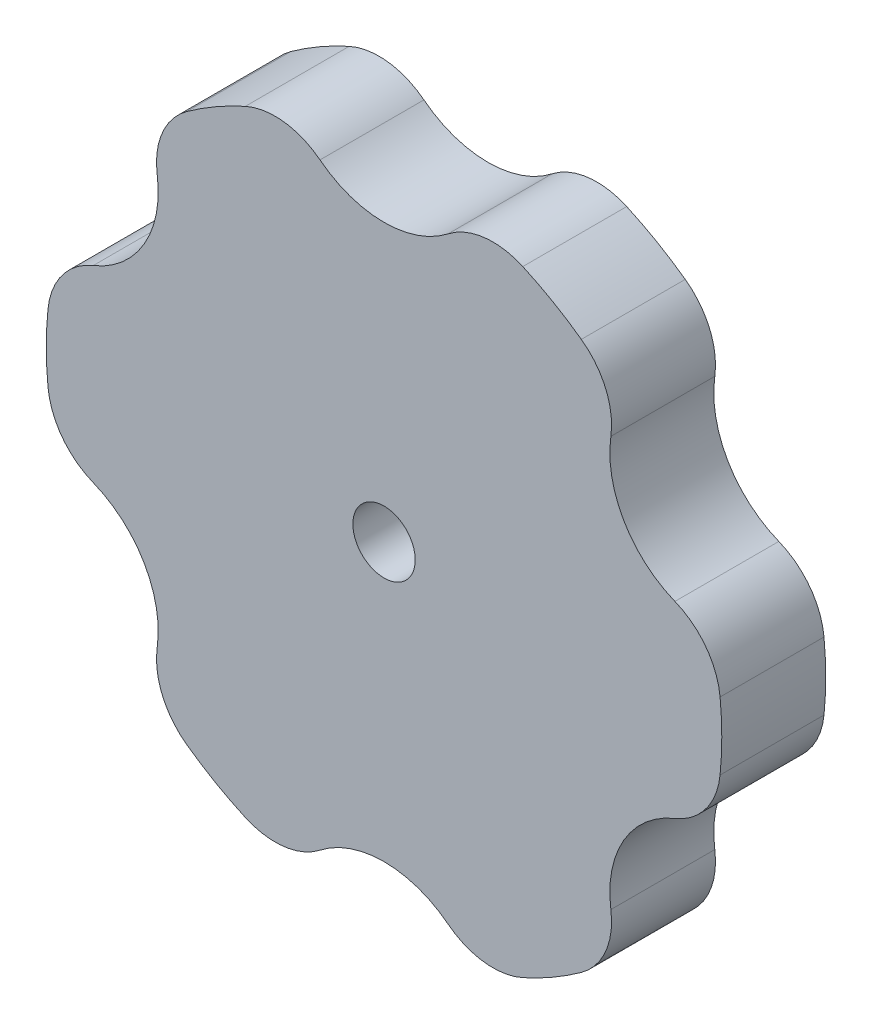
ISO-10303-21;
HEADER;
FILE_DESCRIPTION(('STEP AP214'),'2;1');
FILE_NAME('part.step','',(''),(''),'','','');
FILE_SCHEMA(('AUTOMOTIVE_DESIGN { 1 0 10303 214 1 1 1 1 }'));
ENDSEC;
DATA;
#1=APPLICATION_CONTEXT('core data for automotive mechanical design processes');
#2=APPLICATION_PROTOCOL_DEFINITION('international standard','automotive_design',2000,#1);
#3=PRODUCT_CONTEXT('',#1,'mechanical');
#4=PRODUCT('Part','Part','',(#3));
#5=PRODUCT_RELATED_PRODUCT_CATEGORY('part','',(#4));
#6=PRODUCT_DEFINITION_FORMATION('','',#4);
#7=PRODUCT_DEFINITION_CONTEXT('part definition',#1,'design');
#8=PRODUCT_DEFINITION('design','',#6,#7);
#9=PRODUCT_DEFINITION_SHAPE('','',#8);
#10=(LENGTH_UNIT() NAMED_UNIT(*) SI_UNIT(.MILLI.,.METRE.));
#11=(NAMED_UNIT(*) PLANE_ANGLE_UNIT() SI_UNIT($,.RADIAN.));
#12=(NAMED_UNIT(*) SI_UNIT($,.STERADIAN.) SOLID_ANGLE_UNIT());
#13=UNCERTAINTY_MEASURE_WITH_UNIT(LENGTH_MEASURE(1.E-05),#10,'distance_accuracy_value','');
#14=(GEOMETRIC_REPRESENTATION_CONTEXT(3) GLOBAL_UNCERTAINTY_ASSIGNED_CONTEXT((#13)) GLOBAL_UNIT_ASSIGNED_CONTEXT((#10,
#11,#12)) REPRESENTATION_CONTEXT('',''));
#15=CARTESIAN_POINT('',(0.,0.,0.));
#16=DIRECTION('',(0.,0.,1.));
#17=DIRECTION('',(1.,0.,0.));
#18=AXIS2_PLACEMENT_3D('',#15,#16,#17);
#19=CARTESIAN_POINT('',(-31.7282273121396,-18.3183005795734,10.));
#20=DIRECTION('',(0.,0.,-1.));
#21=DIRECTION('',(-1.,0.,0.));
#22=AXIS2_PLACEMENT_3D('',#19,#20,#21);
#23=CYLINDRICAL_SURFACE('',#22,10.0000000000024);
#24=CARTESIAN_POINT('',(-31.7282273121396,-18.3183005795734,0.));
#25=DIRECTION('',(0.,0.,-1.));
#26=DIRECTION('',(1.,0.,0.));
#27=AXIS2_PLACEMENT_3D('',#24,#25,#26);
#28=CIRCLE('',#27,10.0000000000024);
#29=CARTESIAN_POINT('',(-27.9893002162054,-9.04358095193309,0.));
#30=VERTEX_POINT('',#29);
#31=CARTESIAN_POINT('',(-21.8266209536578,-19.7176545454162,0.));
#32=VERTEX_POINT('',#31);
#33=EDGE_CURVE('E242',#30,#32,#28,.T.);
#34=ORIENTED_EDGE('',*,*,#33,.T.);
#35=DIRECTION('',(0.,0.,-1.));
#36=VECTOR('',#35,1.);
#37=CARTESIAN_POINT('',(-21.8266209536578,-19.7176545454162,10.));
#38=LINE('',#37,#36);
#39=CARTESIAN_POINT('',(-21.8266209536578,-19.7176545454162,10.));
#40=VERTEX_POINT('',#39);
#41=EDGE_CURVE('E11',#40,#32,#38,.T.);
#42=ORIENTED_EDGE('',*,*,#41,.F.);
#43=CARTESIAN_POINT('',(-31.7282273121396,-18.3183005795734,10.));
#44=DIRECTION('',(0.,0.,-1.));
#45=DIRECTION('',(1.,0.,0.));
#46=AXIS2_PLACEMENT_3D('',#43,#44,#45);
#47=CIRCLE('',#46,10.0000000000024);
#48=CARTESIAN_POINT('',(-27.9893002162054,-9.04358095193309,10.));
#49=VERTEX_POINT('',#48);
#50=EDGE_CURVE('E313',#49,#40,#47,.T.);
#51=ORIENTED_EDGE('',*,*,#50,.F.);
#52=DIRECTION('',(0.,0.,-1.));
#53=VECTOR('',#52,1.);
#54=CARTESIAN_POINT('',(-27.9893002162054,-9.04358095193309,10.));
#55=LINE('',#54,#53);
#56=EDGE_CURVE('E238',#49,#30,#55,.T.);
#57=ORIENTED_EDGE('',*,*,#56,.T.);
#58=EDGE_LOOP('',(#34,#42,#51,#57));
#59=FACE_BOUND('',#58,.T.);
#60=ADVANCED_FACE('F45',(#59),#23,.F.);
#61=CARTESIAN_POINT('',(-14.8954965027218,-20.6972023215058,10.));
#62=DIRECTION('',(0.,0.,-1.));
#63=DIRECTION('',(-1.,0.,0.));
#64=AXIS2_PLACEMENT_3D('',#61,#62,#63);
#65=CYLINDRICAL_SURFACE('',#64,7.00000000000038);
#66=CARTESIAN_POINT('',(-14.8954965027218,-20.6972023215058,0.));
#67=DIRECTION('',(0.,0.,1.));
#68=DIRECTION('',(1.,0.,0.));
#69=AXIS2_PLACEMENT_3D('',#66,#67,#68);
#70=CIRCLE('',#69,7.00000000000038);
#71=CARTESIAN_POINT('',(-18.9844563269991,-26.3787872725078,0.));
#72=VERTEX_POINT('',#71);
#73=EDGE_CURVE('E246',#32,#72,#70,.T.);
#74=ORIENTED_EDGE('',*,*,#73,.T.);
#75=DIRECTION('',(0.,0.,-1.));
#76=VECTOR('',#75,1.);
#77=CARTESIAN_POINT('',(-18.9844563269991,-26.3787872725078,10.));
#78=LINE('',#77,#76);
#79=CARTESIAN_POINT('',(-18.9844563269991,-26.3787872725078,10.));
#80=VERTEX_POINT('',#79);
#81=EDGE_CURVE('E54',#80,#72,#78,.T.);
#82=ORIENTED_EDGE('',*,*,#81,.F.);
#83=CARTESIAN_POINT('',(-14.8954965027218,-20.6972023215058,10.));
#84=DIRECTION('',(0.,0.,1.));
#85=DIRECTION('',(1.,0.,0.));
#86=AXIS2_PLACEMENT_3D('',#83,#84,#85);
#87=CIRCLE('',#86,7.00000000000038);
#88=EDGE_CURVE('E153',#40,#80,#87,.T.);
#89=ORIENTED_EDGE('',*,*,#88,.F.);
#90=ORIENTED_EDGE('',*,*,#41,.T.);
#91=EDGE_LOOP('',(#74,#82,#89,#90));
#92=FACE_BOUND('',#91,.T.);
#93=ADVANCED_FACE('F492',(#92),#65,.T.);
#94=CARTESIAN_POINT('',(7.7715611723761E-13,3.33066907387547E-13,10.));
#95=DIRECTION('',(0.,0.,-1.));
#96=DIRECTION('',(-1.,0.,0.));
#97=AXIS2_PLACEMENT_3D('',#94,#95,#96);
#98=CYLINDRICAL_SURFACE('',#97,32.5);
#99=CARTESIAN_POINT('',(7.7715611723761E-13,3.33066907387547E-13,0.));
#100=DIRECTION('',(0.,0.,1.));
#101=DIRECTION('',(1.,0.,0.));
#102=AXIS2_PLACEMENT_3D('',#99,#100,#101);
#103=CIRCLE('',#102,32.5);
#104=CARTESIAN_POINT('',(-13.3524717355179,-29.6304150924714,0.));
#105=VERTEX_POINT('',#104);
#106=EDGE_CURVE('E250',#72,#105,#103,.T.);
#107=ORIENTED_EDGE('',*,*,#106,.T.);
#108=DIRECTION('',(0.,0.,-1.));
#109=VECTOR('',#108,1.);
#110=CARTESIAN_POINT('',(-13.3524717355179,-29.6304150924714,10.));
#111=LINE('',#110,#109);
#112=CARTESIAN_POINT('',(-13.3524717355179,-29.6304150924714,10.));
#113=VERTEX_POINT('',#112);
#114=EDGE_CURVE('E388',#113,#105,#111,.T.);
#115=ORIENTED_EDGE('',*,*,#114,.F.);
#116=CARTESIAN_POINT('',(7.7715611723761E-13,3.33066907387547E-13,10.));
#117=DIRECTION('',(0.,0.,1.));
#118=DIRECTION('',(1.,0.,0.));
#119=AXIS2_PLACEMENT_3D('',#116,#117,#118);
#120=CIRCLE('',#119,32.5);
#121=EDGE_CURVE('E398',#80,#113,#120,.T.);
#122=ORIENTED_EDGE('',*,*,#121,.F.);
#123=ORIENTED_EDGE('',*,*,#81,.T.);
#124=EDGE_LOOP('',(#107,#115,#122,#123));
#125=FACE_BOUND('',#124,.T.);
#126=ADVANCED_FACE('F396',(#125),#98,.T.);
#127=CARTESIAN_POINT('',(-10.4765547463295,-23.2484795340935,10.));
#128=DIRECTION('',(0.,0.,-1.));
#129=DIRECTION('',(-1.,0.,0.));
#130=AXIS2_PLACEMENT_3D('',#127,#128,#129);
#131=CYLINDRICAL_SURFACE('',#130,6.99999999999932);
#132=CARTESIAN_POINT('',(-10.4765547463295,-23.2484795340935,0.));
#133=DIRECTION('',(0.,0.,1.));
#134=DIRECTION('',(1.,0.,0.));
#135=AXIS2_PLACEMENT_3D('',#132,#133,#134);
#136=CIRCLE('',#135,6.99999999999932);
#137=CARTESIAN_POINT('',(-6.16267926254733,-28.7612354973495,0.));
#138=VERTEX_POINT('',#137);
#139=EDGE_CURVE('E253',#105,#138,#136,.T.);
#140=ORIENTED_EDGE('',*,*,#139,.T.);
#141=DIRECTION('',(0.,0.,-1.));
#142=VECTOR('',#141,1.);
#143=CARTESIAN_POINT('',(-6.16267926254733,-28.7612354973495,10.));
#144=LINE('',#143,#142);
#145=CARTESIAN_POINT('',(-6.16267926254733,-28.7612354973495,10.));
#146=VERTEX_POINT('',#145);
#147=EDGE_CURVE('E384',#146,#138,#144,.T.);
#148=ORIENTED_EDGE('',*,*,#147,.F.);
#149=CARTESIAN_POINT('',(-10.4765547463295,-23.2484795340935,10.));
#150=DIRECTION('',(0.,0.,1.));
#151=DIRECTION('',(1.,0.,0.));
#152=AXIS2_PLACEMENT_3D('',#149,#150,#151);
#153=CIRCLE('',#152,6.99999999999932);
#154=EDGE_CURVE('E417',#113,#146,#153,.T.);
#155=ORIENTED_EDGE('',*,*,#154,.F.);
#156=ORIENTED_EDGE('',*,*,#114,.T.);
#157=EDGE_LOOP('',(#140,#148,#155,#156));
#158=FACE_BOUND('',#157,.T.);
#159=ADVANCED_FACE('F407',(#158),#131,.T.);
#160=CARTESIAN_POINT('',(-2.22044604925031E-13,-36.6366011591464,10.));
#161=DIRECTION('',(0.,0.,-1.));
#162=DIRECTION('',(-1.,0.,0.));
#163=AXIS2_PLACEMENT_3D('',#160,#161,#162);
#164=CYLINDRICAL_SURFACE('',#163,10.0000000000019);
#165=CARTESIAN_POINT('',(-2.22044604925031E-13,-36.6366011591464,0.));
#166=DIRECTION('',(0.,0.,-1.));
#167=DIRECTION('',(1.,0.,0.));
#168=AXIS2_PLACEMENT_3D('',#165,#166,#167);
#169=CIRCLE('',#168,10.0000000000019);
#170=CARTESIAN_POINT('',(6.1626792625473,-28.7612354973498,0.));
#171=VERTEX_POINT('',#170);
#172=EDGE_CURVE('E256',#138,#171,#169,.T.);
#173=ORIENTED_EDGE('',*,*,#172,.T.);
#174=DIRECTION('',(0.,0.,-1.));
#175=VECTOR('',#174,1.);
#176=CARTESIAN_POINT('',(6.1626792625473,-28.7612354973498,10.));
#177=LINE('',#176,#175);
#178=CARTESIAN_POINT('',(6.1626792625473,-28.7612354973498,10.));
#179=VERTEX_POINT('',#178);
#180=EDGE_CURVE('E380',#179,#171,#177,.T.);
#181=ORIENTED_EDGE('',*,*,#180,.F.);
#182=CARTESIAN_POINT('',(-2.22044604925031E-13,-36.6366011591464,10.));
#183=DIRECTION('',(0.,0.,-1.));
#184=DIRECTION('',(1.,0.,0.));
#185=AXIS2_PLACEMENT_3D('',#182,#183,#184);
#186=CIRCLE('',#185,10.0000000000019);
#187=EDGE_CURVE('E413',#146,#179,#186,.T.);
#188=ORIENTED_EDGE('',*,*,#187,.F.);
#189=ORIENTED_EDGE('',*,*,#147,.T.);
#190=EDGE_LOOP('',(#173,#181,#188,#189));
#191=FACE_BOUND('',#190,.T.);
#192=ADVANCED_FACE('F411',(#191),#164,.F.);
#193=CARTESIAN_POINT('',(10.4765547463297,-23.2484795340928,10.));
#194=DIRECTION('',(0.,0.,-1.));
#195=DIRECTION('',(-1.,0.,0.));
#196=AXIS2_PLACEMENT_3D('',#193,#194,#195);
#197=CYLINDRICAL_SURFACE('',#196,7.00000000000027);
#198=CARTESIAN_POINT('',(10.4765547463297,-23.2484795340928,0.));
#199=DIRECTION('',(0.,0.,1.));
#200=DIRECTION('',(1.,0.,0.));
#201=AXIS2_PLACEMENT_3D('',#198,#199,#200);
#202=CIRCLE('',#201,7.00000000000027);
#203=CARTESIAN_POINT('',(13.3524717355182,-29.6304150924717,0.));
#204=VERTEX_POINT('',#203);
#205=EDGE_CURVE('E259',#171,#204,#202,.T.);
#206=ORIENTED_EDGE('',*,*,#205,.T.);
#207=DIRECTION('',(0.,0.,-1.));
#208=VECTOR('',#207,1.);
#209=CARTESIAN_POINT('',(13.3524717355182,-29.6304150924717,10.));
#210=LINE('',#209,#208);
#211=CARTESIAN_POINT('',(13.3524717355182,-29.6304150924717,10.));
#212=VERTEX_POINT('',#211);
#213=EDGE_CURVE('E376',#212,#204,#210,.T.);
#214=ORIENTED_EDGE('',*,*,#213,.F.);
#215=CARTESIAN_POINT('',(10.4765547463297,-23.2484795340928,10.));
#216=DIRECTION('',(0.,0.,1.));
#217=DIRECTION('',(1.,0.,0.));
#218=AXIS2_PLACEMENT_3D('',#215,#216,#217);
#219=CIRCLE('',#218,7.00000000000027);
#220=EDGE_CURVE('E416',#179,#212,#219,.T.);
#221=ORIENTED_EDGE('',*,*,#220,.F.);
#222=ORIENTED_EDGE('',*,*,#180,.T.);
#223=EDGE_LOOP('',(#206,#214,#221,#222));
#224=FACE_BOUND('',#223,.T.);
#225=ADVANCED_FACE('F505',(#224),#197,.T.);
#226=CARTESIAN_POINT('',(7.7715611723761E-13,3.33066907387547E-13,10.));
#227=DIRECTION('',(0.,0.,-1.));
#228=DIRECTION('',(-1.,0.,0.));
#229=AXIS2_PLACEMENT_3D('',#226,#227,#228);
#230=CYLINDRICAL_SURFACE('',#229,32.4999999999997);
#231=CARTESIAN_POINT('',(7.7715611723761E-13,3.33066907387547E-13,0.));
#232=DIRECTION('',(0.,0.,1.));
#233=DIRECTION('',(1.,0.,0.));
#234=AXIS2_PLACEMENT_3D('',#231,#232,#233);
#235=CIRCLE('',#234,32.4999999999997);
#236=CARTESIAN_POINT('',(18.9844563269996,-26.3787872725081,0.));
#237=VERTEX_POINT('',#236);
#238=EDGE_CURVE('E262',#204,#237,#235,.T.);
#239=ORIENTED_EDGE('',*,*,#238,.T.);
#240=DIRECTION('',(0.,0.,-1.));
#241=VECTOR('',#240,1.);
#242=CARTESIAN_POINT('',(18.9844563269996,-26.3787872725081,10.));
#243=LINE('',#242,#241);
#244=CARTESIAN_POINT('',(18.9844563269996,-26.3787872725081,10.));
#245=VERTEX_POINT('',#244);
#246=EDGE_CURVE('E372',#245,#237,#243,.T.);
#247=ORIENTED_EDGE('',*,*,#246,.F.);
#248=CARTESIAN_POINT('',(7.7715611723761E-13,3.33066907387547E-13,10.));
#249=DIRECTION('',(0.,0.,1.));
#250=DIRECTION('',(1.,0.,0.));
#251=AXIS2_PLACEMENT_3D('',#248,#249,#250);
#252=CIRCLE('',#251,32.4999999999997);
#253=EDGE_CURVE('E421',#212,#245,#252,.T.);
#254=ORIENTED_EDGE('',*,*,#253,.F.);
#255=ORIENTED_EDGE('',*,*,#213,.T.);
#256=EDGE_LOOP('',(#239,#247,#254,#255));
#257=FACE_BOUND('',#256,.T.);
#258=ADVANCED_FACE('F508',(#257),#230,.T.);
#259=CARTESIAN_POINT('',(14.8954965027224,-20.6972023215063,10.));
#260=DIRECTION('',(0.,0.,-1.));
#261=DIRECTION('',(-1.,0.,0.));
#262=AXIS2_PLACEMENT_3D('',#259,#260,#261);
#263=CYLINDRICAL_SURFACE('',#262,7.00000000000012);
#264=CARTESIAN_POINT('',(14.8954965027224,-20.6972023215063,0.));
#265=DIRECTION('',(0.,0.,1.));
#266=DIRECTION('',(1.,0.,0.));
#267=AXIS2_PLACEMENT_3D('',#264,#265,#266);
#268=CIRCLE('',#267,7.00000000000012);
#269=CARTESIAN_POINT('',(21.8266209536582,-19.7176545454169,0.));
#270=VERTEX_POINT('',#269);
#271=EDGE_CURVE('E265',#237,#270,#268,.T.);
#272=ORIENTED_EDGE('',*,*,#271,.T.);
#273=DIRECTION('',(0.,0.,-1.));
#274=VECTOR('',#273,1.);
#275=CARTESIAN_POINT('',(21.8266209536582,-19.7176545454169,10.));
#276=LINE('',#275,#274);
#277=CARTESIAN_POINT('',(21.8266209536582,-19.7176545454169,10.));
#278=VERTEX_POINT('',#277);
#279=EDGE_CURVE('E368',#278,#270,#276,.T.);
#280=ORIENTED_EDGE('',*,*,#279,.F.);
#281=CARTESIAN_POINT('',(14.8954965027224,-20.6972023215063,10.));
#282=DIRECTION('',(0.,0.,1.));
#283=DIRECTION('',(1.,0.,0.));
#284=AXIS2_PLACEMENT_3D('',#281,#282,#283);
#285=CIRCLE('',#284,7.00000000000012);
#286=EDGE_CURVE('E428',#245,#278,#285,.T.);
#287=ORIENTED_EDGE('',*,*,#286,.F.);
#288=ORIENTED_EDGE('',*,*,#246,.T.);
#289=EDGE_LOOP('',(#272,#280,#287,#288));
#290=FACE_BOUND('',#289,.T.);
#291=ADVANCED_FACE('F512',(#290),#263,.T.);
#292=CARTESIAN_POINT('',(31.7282273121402,-18.3183005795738,10.));
#293=DIRECTION('',(0.,0.,-1.));
#294=DIRECTION('',(-1.,0.,0.));
#295=AXIS2_PLACEMENT_3D('',#292,#293,#294);
#296=CYLINDRICAL_SURFACE('',#295,10.0000000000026);
#297=CARTESIAN_POINT('',(31.7282273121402,-18.3183005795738,0.));
#298=DIRECTION('',(0.,0.,-1.));
#299=DIRECTION('',(1.,0.,0.));
#300=AXIS2_PLACEMENT_3D('',#297,#298,#299);
#301=CIRCLE('',#300,10.0000000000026);
#302=CARTESIAN_POINT('',(27.9893002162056,-9.04358095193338,0.));
#303=VERTEX_POINT('',#302);
#304=EDGE_CURVE('E268',#270,#303,#301,.T.);
#305=ORIENTED_EDGE('',*,*,#304,.T.);
#306=DIRECTION('',(0.,0.,-1.));
#307=VECTOR('',#306,1.);
#308=CARTESIAN_POINT('',(27.9893002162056,-9.04358095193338,10.));
#309=LINE('',#308,#307);
#310=CARTESIAN_POINT('',(27.9893002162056,-9.04358095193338,10.));
#311=VERTEX_POINT('',#310);
#312=EDGE_CURVE('E364',#311,#303,#309,.T.);
#313=ORIENTED_EDGE('',*,*,#312,.F.);
#314=CARTESIAN_POINT('',(31.7282273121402,-18.3183005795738,10.));
#315=DIRECTION('',(0.,0.,-1.));
#316=DIRECTION('',(1.,0.,0.));
#317=AXIS2_PLACEMENT_3D('',#314,#315,#316);
#318=CIRCLE('',#317,10.0000000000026);
#319=EDGE_CURVE('E431',#278,#311,#318,.T.);
#320=ORIENTED_EDGE('',*,*,#319,.F.);
#321=ORIENTED_EDGE('',*,*,#279,.T.);
#322=EDGE_LOOP('',(#305,#313,#320,#321));
#323=FACE_BOUND('',#322,.T.);
#324=ADVANCED_FACE('F516',(#323),#296,.F.);
#325=CARTESIAN_POINT('',(25.3720512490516,-2.55127721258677,10.));
#326=DIRECTION('',(0.,0.,-1.));
#327=DIRECTION('',(-1.,0.,0.));
#328=AXIS2_PLACEMENT_3D('',#325,#326,#327);
#329=CYLINDRICAL_SURFACE('',#328,7.00000000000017);
#330=CARTESIAN_POINT('',(25.3720512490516,-2.55127721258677,0.));
#331=DIRECTION('',(0.,0.,1.));
#332=DIRECTION('',(1.,0.,0.));
#333=AXIS2_PLACEMENT_3D('',#330,#331,#332);
#334=CIRCLE('',#333,7.00000000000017);
#335=CARTESIAN_POINT('',(32.3369280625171,-3.25162781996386,0.));
#336=VERTEX_POINT('',#335);
#337=EDGE_CURVE('E271',#303,#336,#334,.T.);
#338=ORIENTED_EDGE('',*,*,#337,.T.);
#339=DIRECTION('',(0.,0.,-1.));
#340=VECTOR('',#339,1.);
#341=CARTESIAN_POINT('',(32.3369280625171,-3.25162781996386,10.));
#342=LINE('',#341,#340);
#343=CARTESIAN_POINT('',(32.3369280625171,-3.25162781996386,10.));
#344=VERTEX_POINT('',#343);
#345=EDGE_CURVE('E360',#344,#336,#342,.T.);
#346=ORIENTED_EDGE('',*,*,#345,.F.);
#347=CARTESIAN_POINT('',(25.3720512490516,-2.55127721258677,10.));
#348=DIRECTION('',(0.,0.,1.));
#349=DIRECTION('',(1.,0.,0.));
#350=AXIS2_PLACEMENT_3D('',#347,#348,#349);
#351=CIRCLE('',#350,7.00000000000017);
#352=EDGE_CURVE('E434',#311,#344,#351,.T.);
#353=ORIENTED_EDGE('',*,*,#352,.F.);
#354=ORIENTED_EDGE('',*,*,#312,.T.);
#355=EDGE_LOOP('',(#338,#346,#353,#354));
#356=FACE_BOUND('',#355,.T.);
#357=ADVANCED_FACE('F520',(#356),#329,.T.);
#358=CARTESIAN_POINT('',(7.7715611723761E-13,3.33066907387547E-13,10.));
#359=DIRECTION('',(0.,0.,-1.));
#360=DIRECTION('',(-1.,0.,0.));
#361=AXIS2_PLACEMENT_3D('',#358,#359,#360);
#362=CYLINDRICAL_SURFACE('',#361,32.4999999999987);
#363=CARTESIAN_POINT('',(7.7715611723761E-13,3.33066907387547E-13,0.));
#364=DIRECTION('',(0.,0.,1.));
#365=DIRECTION('',(1.,0.,0.));
#366=AXIS2_PLACEMENT_3D('',#363,#364,#365);
#367=CIRCLE('',#366,32.4999999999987);
#368=CARTESIAN_POINT('',(32.3369280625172,3.25162781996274,0.));
#369=VERTEX_POINT('',#368);
#370=EDGE_CURVE('E274',#336,#369,#367,.T.);
#371=ORIENTED_EDGE('',*,*,#370,.T.);
#372=DIRECTION('',(0.,0.,-1.));
#373=VECTOR('',#372,1.);
#374=CARTESIAN_POINT('',(32.3369280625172,3.25162781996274,10.));
#375=LINE('',#374,#373);
#376=CARTESIAN_POINT('',(32.3369280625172,3.25162781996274,10.));
#377=VERTEX_POINT('',#376);
#378=EDGE_CURVE('E356',#377,#369,#375,.T.);
#379=ORIENTED_EDGE('',*,*,#378,.F.);
#380=CARTESIAN_POINT('',(7.7715611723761E-13,3.33066907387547E-13,10.));
#381=DIRECTION('',(0.,0.,1.));
#382=DIRECTION('',(1.,0.,0.));
#383=AXIS2_PLACEMENT_3D('',#380,#381,#382);
#384=CIRCLE('',#383,32.4999999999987);
#385=EDGE_CURVE('E437',#344,#377,#384,.T.);
#386=ORIENTED_EDGE('',*,*,#385,.F.);
#387=ORIENTED_EDGE('',*,*,#345,.T.);
#388=EDGE_LOOP('',(#371,#379,#386,#387));
#389=FACE_BOUND('',#388,.T.);
#390=ADVANCED_FACE('F524',(#389),#362,.T.);
#391=CARTESIAN_POINT('',(25.3720512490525,2.55127721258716,10.));
#392=DIRECTION('',(0.,0.,-1.));
#393=DIRECTION('',(-1.,0.,0.));
#394=AXIS2_PLACEMENT_3D('',#391,#392,#393);
#395=CYLINDRICAL_SURFACE('',#394,6.99999999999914);
#396=CARTESIAN_POINT('',(25.3720512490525,2.55127721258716,0.));
#397=DIRECTION('',(0.,0.,1.));
#398=DIRECTION('',(1.,0.,0.));
#399=AXIS2_PLACEMENT_3D('',#396,#397,#398);
#400=CIRCLE('',#399,6.99999999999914);
#401=CARTESIAN_POINT('',(27.9893002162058,9.04358095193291,0.));
#402=VERTEX_POINT('',#401);
#403=EDGE_CURVE('E277',#369,#402,#400,.T.);
#404=ORIENTED_EDGE('',*,*,#403,.T.);
#405=DIRECTION('',(0.,0.,-1.));
#406=VECTOR('',#405,1.);
#407=CARTESIAN_POINT('',(27.9893002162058,9.04358095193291,10.));
#408=LINE('',#407,#406);
#409=CARTESIAN_POINT('',(27.9893002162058,9.04358095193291,10.));
#410=VERTEX_POINT('',#409);
#411=EDGE_CURVE('E352',#410,#402,#408,.T.);
#412=ORIENTED_EDGE('',*,*,#411,.F.);
#413=CARTESIAN_POINT('',(25.3720512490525,2.55127721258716,10.));
#414=DIRECTION('',(0.,0.,1.));
#415=DIRECTION('',(1.,0.,0.));
#416=AXIS2_PLACEMENT_3D('',#413,#414,#415);
#417=CIRCLE('',#416,6.99999999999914);
#418=EDGE_CURVE('E440',#377,#410,#417,.T.);
#419=ORIENTED_EDGE('',*,*,#418,.F.);
#420=ORIENTED_EDGE('',*,*,#378,.T.);
#421=EDGE_LOOP('',(#404,#412,#419,#420));
#422=FACE_BOUND('',#421,.T.);
#423=ADVANCED_FACE('F528',(#422),#395,.T.);
#424=CARTESIAN_POINT('',(31.7282273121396,18.3183005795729,10.));
#425=DIRECTION('',(0.,0.,-1.));
#426=DIRECTION('',(-1.,0.,0.));
#427=AXIS2_PLACEMENT_3D('',#424,#425,#426);
#428=CYLINDRICAL_SURFACE('',#427,10.0000000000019);
#429=CARTESIAN_POINT('',(31.7282273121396,18.3183005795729,0.));
#430=DIRECTION('',(0.,0.,-1.));
#431=DIRECTION('',(1.,0.,0.));
#432=AXIS2_PLACEMENT_3D('',#429,#430,#431);
#433=CIRCLE('',#432,10.0000000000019);
#434=CARTESIAN_POINT('',(21.8266209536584,19.7176545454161,0.));
#435=VERTEX_POINT('',#434);
#436=EDGE_CURVE('E280',#402,#435,#433,.T.);
#437=ORIENTED_EDGE('',*,*,#436,.T.);
#438=DIRECTION('',(0.,0.,-1.));
#439=VECTOR('',#438,1.);
#440=CARTESIAN_POINT('',(21.8266209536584,19.7176545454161,10.));
#441=LINE('',#440,#439);
#442=CARTESIAN_POINT('',(21.8266209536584,19.7176545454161,10.));
#443=VERTEX_POINT('',#442);
#444=EDGE_CURVE('E348',#443,#435,#441,.T.);
#445=ORIENTED_EDGE('',*,*,#444,.F.);
#446=CARTESIAN_POINT('',(31.7282273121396,18.3183005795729,10.));
#447=DIRECTION('',(0.,0.,-1.));
#448=DIRECTION('',(1.,0.,0.));
#449=AXIS2_PLACEMENT_3D('',#446,#447,#448);
#450=CIRCLE('',#449,10.0000000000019);
#451=EDGE_CURVE('E443',#410,#443,#450,.T.);
#452=ORIENTED_EDGE('',*,*,#451,.F.);
#453=ORIENTED_EDGE('',*,*,#411,.T.);
#454=EDGE_LOOP('',(#437,#445,#452,#453));
#455=FACE_BOUND('',#454,.T.);
#456=ADVANCED_FACE('F532',(#455),#428,.F.);
#457=CARTESIAN_POINT('',(14.8954965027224,20.6972023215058,10.));
#458=DIRECTION('',(0.,0.,-1.));
#459=DIRECTION('',(-1.,0.,0.));
#460=AXIS2_PLACEMENT_3D('',#457,#458,#459);
#461=CYLINDRICAL_SURFACE('',#460,7.0000000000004);
#462=CARTESIAN_POINT('',(14.8954965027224,20.6972023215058,0.));
#463=DIRECTION('',(0.,0.,1.));
#464=DIRECTION('',(1.,0.,0.));
#465=AXIS2_PLACEMENT_3D('',#462,#463,#464);
#466=CIRCLE('',#465,7.0000000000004);
#467=CARTESIAN_POINT('',(18.9844563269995,26.3787872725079,0.));
#468=VERTEX_POINT('',#467);
#469=EDGE_CURVE('E283',#435,#468,#466,.T.);
#470=ORIENTED_EDGE('',*,*,#469,.T.);
#471=DIRECTION('',(0.,0.,-1.));
#472=VECTOR('',#471,1.);
#473=CARTESIAN_POINT('',(18.9844563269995,26.3787872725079,10.));
#474=LINE('',#473,#472);
#475=CARTESIAN_POINT('',(18.9844563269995,26.3787872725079,10.));
#476=VERTEX_POINT('',#475);
#477=EDGE_CURVE('E344',#476,#468,#474,.T.);
#478=ORIENTED_EDGE('',*,*,#477,.F.);
#479=CARTESIAN_POINT('',(14.8954965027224,20.6972023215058,10.));
#480=DIRECTION('',(0.,0.,1.));
#481=DIRECTION('',(1.,0.,0.));
#482=AXIS2_PLACEMENT_3D('',#479,#480,#481);
#483=CIRCLE('',#482,7.0000000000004);
#484=EDGE_CURVE('E446',#443,#476,#483,.T.);
#485=ORIENTED_EDGE('',*,*,#484,.F.);
#486=ORIENTED_EDGE('',*,*,#444,.T.);
#487=EDGE_LOOP('',(#470,#478,#485,#486));
#488=FACE_BOUND('',#487,.T.);
#489=ADVANCED_FACE('F536',(#488),#461,.T.);
#490=CARTESIAN_POINT('',(7.7715611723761E-13,3.33066907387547E-13,10.));
#491=DIRECTION('',(0.,0.,-1.));
#492=DIRECTION('',(-1.,0.,0.));
#493=AXIS2_PLACEMENT_3D('',#490,#491,#492);
#494=CYLINDRICAL_SURFACE('',#493,32.499999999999);
#495=CARTESIAN_POINT('',(7.7715611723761E-13,3.33066907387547E-13,0.));
#496=DIRECTION('',(0.,0.,1.));
#497=DIRECTION('',(1.,0.,0.));
#498=AXIS2_PLACEMENT_3D('',#495,#496,#497);
#499=CIRCLE('',#498,32.499999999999);
#500=CARTESIAN_POINT('',(13.3524717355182,29.6304150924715,0.));
#501=VERTEX_POINT('',#500);
#502=EDGE_CURVE('E286',#468,#501,#499,.T.);
#503=ORIENTED_EDGE('',*,*,#502,.T.);
#504=DIRECTION('',(0.,0.,-1.));
#505=VECTOR('',#504,1.);
#506=CARTESIAN_POINT('',(13.3524717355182,29.6304150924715,10.));
#507=LINE('',#506,#505);
#508=CARTESIAN_POINT('',(13.3524717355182,29.6304150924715,10.));
#509=VERTEX_POINT('',#508);
#510=EDGE_CURVE('E340',#509,#501,#507,.T.);
#511=ORIENTED_EDGE('',*,*,#510,.F.);
#512=CARTESIAN_POINT('',(7.7715611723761E-13,3.33066907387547E-13,10.));
#513=DIRECTION('',(0.,0.,1.));
#514=DIRECTION('',(1.,0.,0.));
#515=AXIS2_PLACEMENT_3D('',#512,#513,#514);
#516=CIRCLE('',#515,32.499999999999);
#517=EDGE_CURVE('E449',#476,#509,#516,.T.);
#518=ORIENTED_EDGE('',*,*,#517,.F.);
#519=ORIENTED_EDGE('',*,*,#477,.T.);
#520=EDGE_LOOP('',(#503,#511,#518,#519));
#521=FACE_BOUND('',#520,.T.);
#522=ADVANCED_FACE('F540',(#521),#494,.T.);
#523=CARTESIAN_POINT('',(10.4765547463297,23.2484795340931,10.));
#524=DIRECTION('',(0.,0.,-1.));
#525=DIRECTION('',(-1.,0.,0.));
#526=AXIS2_PLACEMENT_3D('',#523,#524,#525);
#527=CYLINDRICAL_SURFACE('',#526,6.99999999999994);
#528=CARTESIAN_POINT('',(10.4765547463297,23.2484795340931,0.));
#529=DIRECTION('',(0.,0.,1.));
#530=DIRECTION('',(1.,0.,0.));
#531=AXIS2_PLACEMENT_3D('',#528,#529,#530);
#532=CIRCLE('',#531,6.99999999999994);
#533=CARTESIAN_POINT('',(6.16267926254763,28.7612354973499,0.));
#534=VERTEX_POINT('',#533);
#535=EDGE_CURVE('E289',#501,#534,#532,.T.);
#536=ORIENTED_EDGE('',*,*,#535,.T.);
#537=DIRECTION('',(0.,0.,-1.));
#538=VECTOR('',#537,1.);
#539=CARTESIAN_POINT('',(6.16267926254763,28.7612354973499,10.));
#540=LINE('',#539,#538);
#541=CARTESIAN_POINT('',(6.16267926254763,28.7612354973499,10.));
#542=VERTEX_POINT('',#541);
#543=EDGE_CURVE('E336',#542,#534,#540,.T.);
#544=ORIENTED_EDGE('',*,*,#543,.F.);
#545=CARTESIAN_POINT('',(10.4765547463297,23.2484795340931,10.));
#546=DIRECTION('',(0.,0.,1.));
#547=DIRECTION('',(1.,0.,0.));
#548=AXIS2_PLACEMENT_3D('',#545,#546,#547);
#549=CIRCLE('',#548,6.99999999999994);
#550=EDGE_CURVE('E452',#509,#542,#549,.T.);
#551=ORIENTED_EDGE('',*,*,#550,.F.);
#552=ORIENTED_EDGE('',*,*,#510,.T.);
#553=EDGE_LOOP('',(#536,#544,#551,#552));
#554=FACE_BOUND('',#553,.T.);
#555=ADVANCED_FACE('F544',(#554),#527,.T.);
#556=CARTESIAN_POINT('',(2.22044604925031E-13,36.6366011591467,10.));
#557=DIRECTION('',(0.,0.,-1.));
#558=DIRECTION('',(-1.,0.,0.));
#559=AXIS2_PLACEMENT_3D('',#556,#557,#558);
#560=CYLINDRICAL_SURFACE('',#559,10.000000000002);
#561=CARTESIAN_POINT('',(2.22044604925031E-13,36.6366011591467,0.));
#562=DIRECTION('',(0.,0.,-1.));
#563=DIRECTION('',(1.,0.,0.));
#564=AXIS2_PLACEMENT_3D('',#561,#562,#563);
#565=CIRCLE('',#564,10.000000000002);
#566=CARTESIAN_POINT('',(-6.16267926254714,28.7612354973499,0.));
#567=VERTEX_POINT('',#566);
#568=EDGE_CURVE('E292',#534,#567,#565,.T.);
#569=ORIENTED_EDGE('',*,*,#568,.T.);
#570=DIRECTION('',(0.,0.,-1.));
#571=VECTOR('',#570,1.);
#572=CARTESIAN_POINT('',(-6.16267926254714,28.7612354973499,10.));
#573=LINE('',#572,#571);
#574=CARTESIAN_POINT('',(-6.16267926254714,28.7612354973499,10.));
#575=VERTEX_POINT('',#574);
#576=EDGE_CURVE('E332',#575,#567,#573,.T.);
#577=ORIENTED_EDGE('',*,*,#576,.F.);
#578=CARTESIAN_POINT('',(2.22044604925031E-13,36.6366011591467,10.));
#579=DIRECTION('',(0.,0.,-1.));
#580=DIRECTION('',(1.,0.,0.));
#581=AXIS2_PLACEMENT_3D('',#578,#579,#580);
#582=CIRCLE('',#581,10.000000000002);
#583=EDGE_CURVE('E455',#542,#575,#582,.T.);
#584=ORIENTED_EDGE('',*,*,#583,.F.);
#585=ORIENTED_EDGE('',*,*,#543,.T.);
#586=EDGE_LOOP('',(#569,#577,#584,#585));
#587=FACE_BOUND('',#586,.T.);
#588=ADVANCED_FACE('F548',(#587),#560,.F.);
#589=CARTESIAN_POINT('',(-10.4765547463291,23.2484795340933,10.));
#590=DIRECTION('',(0.,0.,-1.));
#591=DIRECTION('',(-1.,0.,0.));
#592=AXIS2_PLACEMENT_3D('',#589,#590,#591);
#593=CYLINDRICAL_SURFACE('',#592,6.99999999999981);
#594=CARTESIAN_POINT('',(-10.4765547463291,23.2484795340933,0.));
#595=DIRECTION('',(0.,0.,1.));
#596=DIRECTION('',(1.,0.,0.));
#597=AXIS2_PLACEMENT_3D('',#594,#595,#596);
#598=CIRCLE('',#597,6.99999999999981);
#599=CARTESIAN_POINT('',(-13.3524717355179,29.6304150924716,0.));
#600=VERTEX_POINT('',#599);
#601=EDGE_CURVE('E295',#567,#600,#598,.T.);
#602=ORIENTED_EDGE('',*,*,#601,.T.);
#603=DIRECTION('',(0.,0.,-1.));
#604=VECTOR('',#603,1.);
#605=CARTESIAN_POINT('',(-13.3524717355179,29.6304150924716,10.));
#606=LINE('',#605,#604);
#607=CARTESIAN_POINT('',(-13.3524717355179,29.6304150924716,10.));
#608=VERTEX_POINT('',#607);
#609=EDGE_CURVE('E328',#608,#600,#606,.T.);
#610=ORIENTED_EDGE('',*,*,#609,.F.);
#611=CARTESIAN_POINT('',(-10.4765547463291,23.2484795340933,10.));
#612=DIRECTION('',(0.,0.,1.));
#613=DIRECTION('',(1.,0.,0.));
#614=AXIS2_PLACEMENT_3D('',#611,#612,#613);
#615=CIRCLE('',#614,6.99999999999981);
#616=EDGE_CURVE('E458',#575,#608,#615,.T.);
#617=ORIENTED_EDGE('',*,*,#616,.F.);
#618=ORIENTED_EDGE('',*,*,#576,.T.);
#619=EDGE_LOOP('',(#602,#610,#617,#618));
#620=FACE_BOUND('',#619,.T.);
#621=ADVANCED_FACE('F552',(#620),#593,.T.);
#622=CARTESIAN_POINT('',(7.7715611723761E-13,3.33066907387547E-13,10.));
#623=DIRECTION('',(0.,0.,-1.));
#624=DIRECTION('',(-1.,0.,0.));
#625=AXIS2_PLACEMENT_3D('',#622,#623,#624);
#626=CYLINDRICAL_SURFACE('',#625,32.4999999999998);
#627=CARTESIAN_POINT('',(7.7715611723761E-13,3.33066907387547E-13,0.));
#628=DIRECTION('',(0.,0.,1.));
#629=DIRECTION('',(1.,0.,0.));
#630=AXIS2_PLACEMENT_3D('',#627,#628,#629);
#631=CIRCLE('',#630,32.4999999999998);
#632=CARTESIAN_POINT('',(-18.984456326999,26.3787872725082,0.));
#633=VERTEX_POINT('',#632);
#634=EDGE_CURVE('E298',#600,#633,#631,.T.);
#635=ORIENTED_EDGE('',*,*,#634,.T.);
#636=DIRECTION('',(0.,0.,-1.));
#637=VECTOR('',#636,1.);
#638=CARTESIAN_POINT('',(-18.984456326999,26.3787872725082,10.));
#639=LINE('',#638,#637);
#640=CARTESIAN_POINT('',(-18.984456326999,26.3787872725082,10.));
#641=VERTEX_POINT('',#640);
#642=EDGE_CURVE('E324',#641,#633,#639,.T.);
#643=ORIENTED_EDGE('',*,*,#642,.F.);
#644=CARTESIAN_POINT('',(7.7715611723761E-13,3.33066907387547E-13,10.));
#645=DIRECTION('',(0.,0.,1.));
#646=DIRECTION('',(1.,0.,0.));
#647=AXIS2_PLACEMENT_3D('',#644,#645,#646);
#648=CIRCLE('',#647,32.4999999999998);
#649=EDGE_CURVE('E461',#608,#641,#648,.T.);
#650=ORIENTED_EDGE('',*,*,#649,.F.);
#651=ORIENTED_EDGE('',*,*,#609,.T.);
#652=EDGE_LOOP('',(#635,#643,#650,#651));
#653=FACE_BOUND('',#652,.T.);
#654=ADVANCED_FACE('F556',(#653),#626,.T.);
#655=CARTESIAN_POINT('',(-14.8954965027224,20.6972023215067,10.));
#656=DIRECTION('',(0.,0.,-1.));
#657=DIRECTION('',(-1.,0.,0.));
#658=AXIS2_PLACEMENT_3D('',#655,#656,#657);
#659=CYLINDRICAL_SURFACE('',#658,6.99999999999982);
#660=CARTESIAN_POINT('',(-14.8954965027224,20.6972023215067,0.));
#661=DIRECTION('',(0.,0.,1.));
#662=DIRECTION('',(1.,0.,0.));
#663=AXIS2_PLACEMENT_3D('',#660,#661,#662);
#664=CIRCLE('',#663,6.99999999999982);
#665=CARTESIAN_POINT('',(-21.8266209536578,19.7176545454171,0.));
#666=VERTEX_POINT('',#665);
#667=EDGE_CURVE('E301',#633,#666,#664,.T.);
#668=ORIENTED_EDGE('',*,*,#667,.T.);
#669=DIRECTION('',(0.,0.,-1.));
#670=VECTOR('',#669,1.);
#671=CARTESIAN_POINT('',(-21.8266209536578,19.7176545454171,10.));
#672=LINE('',#671,#670);
#673=CARTESIAN_POINT('',(-21.8266209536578,19.7176545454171,10.));
#674=VERTEX_POINT('',#673);
#675=EDGE_CURVE('E320',#674,#666,#672,.T.);
#676=ORIENTED_EDGE('',*,*,#675,.F.);
#677=CARTESIAN_POINT('',(-14.8954965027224,20.6972023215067,10.));
#678=DIRECTION('',(0.,0.,1.));
#679=DIRECTION('',(1.,0.,0.));
#680=AXIS2_PLACEMENT_3D('',#677,#678,#679);
#681=CIRCLE('',#680,6.99999999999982);
#682=EDGE_CURVE('E464',#641,#674,#681,.T.);
#683=ORIENTED_EDGE('',*,*,#682,.F.);
#684=ORIENTED_EDGE('',*,*,#642,.T.);
#685=EDGE_LOOP('',(#668,#676,#683,#684));
#686=FACE_BOUND('',#685,.T.);
#687=ADVANCED_FACE('F472',(#686),#659,.T.);
#688=CARTESIAN_POINT('',(-31.72822731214,18.3183005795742,10.));
#689=DIRECTION('',(0.,0.,-1.));
#690=DIRECTION('',(-1.,0.,0.));
#691=AXIS2_PLACEMENT_3D('',#688,#689,#690);
#692=CYLINDRICAL_SURFACE('',#691,10.0000000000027);
#693=CARTESIAN_POINT('',(-31.72822731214,18.3183005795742,0.));
#694=DIRECTION('',(0.,0.,-1.));
#695=DIRECTION('',(1.,0.,0.));
#696=AXIS2_PLACEMENT_3D('',#693,#694,#695);
#697=CIRCLE('',#696,10.0000000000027);
#698=CARTESIAN_POINT('',(-27.9893002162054,9.04358095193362,0.));
#699=VERTEX_POINT('',#698);
#700=EDGE_CURVE('E304',#666,#699,#697,.T.);
#701=ORIENTED_EDGE('',*,*,#700,.T.);
#702=DIRECTION('',(0.,0.,-1.));
#703=VECTOR('',#702,1.);
#704=CARTESIAN_POINT('',(-27.9893002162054,9.04358095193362,10.));
#705=LINE('',#704,#703);
#706=CARTESIAN_POINT('',(-27.9893002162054,9.04358095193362,10.));
#707=VERTEX_POINT('',#706);
#708=EDGE_CURVE('E231',#707,#699,#705,.T.);
#709=ORIENTED_EDGE('',*,*,#708,.F.);
#710=CARTESIAN_POINT('',(-31.72822731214,18.3183005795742,10.));
#711=DIRECTION('',(0.,0.,-1.));
#712=DIRECTION('',(1.,0.,0.));
#713=AXIS2_PLACEMENT_3D('',#710,#711,#712);
#714=CIRCLE('',#713,10.0000000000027);
#715=EDGE_CURVE('E220',#674,#707,#714,.T.);
#716=ORIENTED_EDGE('',*,*,#715,.F.);
#717=ORIENTED_EDGE('',*,*,#675,.T.);
#718=EDGE_LOOP('',(#701,#709,#716,#717));
#719=FACE_BOUND('',#718,.T.);
#720=ADVANCED_FACE('F476',(#719),#692,.F.);
#721=CARTESIAN_POINT('',(-25.372051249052,2.55127721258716,10.));
#722=DIRECTION('',(0.,0.,-1.));
#723=DIRECTION('',(-1.,0.,0.));
#724=AXIS2_PLACEMENT_3D('',#721,#722,#723);
#725=CYLINDRICAL_SURFACE('',#724,6.99999999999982);
#726=CARTESIAN_POINT('',(-25.372051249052,2.55127721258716,0.));
#727=DIRECTION('',(0.,0.,1.));
#728=DIRECTION('',(1.,0.,0.));
#729=AXIS2_PLACEMENT_3D('',#726,#727,#728);
#730=CIRCLE('',#729,6.99999999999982);
#731=CARTESIAN_POINT('',(-32.3369280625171,3.25162781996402,0.));
#732=VERTEX_POINT('',#731);
#733=EDGE_CURVE('E229',#699,#732,#730,.T.);
#734=ORIENTED_EDGE('',*,*,#733,.T.);
#735=DIRECTION('',(0.,0.,-1.));
#736=VECTOR('',#735,1.);
#737=CARTESIAN_POINT('',(-32.3369280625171,3.25162781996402,10.));
#738=LINE('',#737,#736);
#739=CARTESIAN_POINT('',(-32.3369280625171,3.25162781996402,10.));
#740=VERTEX_POINT('',#739);
#741=EDGE_CURVE('E226',#740,#732,#738,.T.);
#742=ORIENTED_EDGE('',*,*,#741,.F.);
#743=CARTESIAN_POINT('',(-25.372051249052,2.55127721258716,10.));
#744=DIRECTION('',(0.,0.,1.));
#745=DIRECTION('',(1.,0.,0.));
#746=AXIS2_PLACEMENT_3D('',#743,#744,#745);
#747=CIRCLE('',#746,6.99999999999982);
#748=EDGE_CURVE('E214',#707,#740,#747,.T.);
#749=ORIENTED_EDGE('',*,*,#748,.F.);
#750=ORIENTED_EDGE('',*,*,#708,.T.);
#751=EDGE_LOOP('',(#734,#742,#749,#750));
#752=FACE_BOUND('',#751,.T.);
#753=ADVANCED_FACE('F227',(#752),#725,.T.);
#754=CARTESIAN_POINT('',(7.7715611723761E-13,3.33066907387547E-13,10.));
#755=DIRECTION('',(0.,0.,-1.));
#756=DIRECTION('',(-1.,0.,0.));
#757=AXIS2_PLACEMENT_3D('',#754,#755,#756);
#758=CYLINDRICAL_SURFACE('',#757,32.5000000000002);
#759=CARTESIAN_POINT('',(7.7715611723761E-13,3.33066907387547E-13,0.));
#760=DIRECTION('',(0.,0.,1.));
#761=DIRECTION('',(1.,0.,0.));
#762=AXIS2_PLACEMENT_3D('',#759,#760,#761);
#763=CIRCLE('',#762,32.5000000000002);
#764=CARTESIAN_POINT('',(-32.3369280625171,-3.2516278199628,0.));
#765=VERTEX_POINT('',#764);
#766=EDGE_CURVE('E139',#732,#765,#763,.T.);
#767=ORIENTED_EDGE('',*,*,#766,.T.);
#768=DIRECTION('',(0.,0.,-1.));
#769=VECTOR('',#768,1.);
#770=CARTESIAN_POINT('',(-32.3369280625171,-3.2516278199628,10.));
#771=LINE('',#770,#769);
#772=CARTESIAN_POINT('',(-32.3369280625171,-3.2516278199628,10.));
#773=VERTEX_POINT('',#772);
#774=EDGE_CURVE('E232',#773,#765,#771,.T.);
#775=ORIENTED_EDGE('',*,*,#774,.F.);
#776=CARTESIAN_POINT('',(7.7715611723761E-13,3.33066907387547E-13,10.));
#777=DIRECTION('',(0.,0.,1.));
#778=DIRECTION('',(1.,0.,0.));
#779=AXIS2_PLACEMENT_3D('',#776,#777,#778);
#780=CIRCLE('',#779,32.5000000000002);
#781=EDGE_CURVE('E218',#740,#773,#780,.T.);
#782=ORIENTED_EDGE('',*,*,#781,.F.);
#783=ORIENTED_EDGE('',*,*,#741,.T.);
#784=EDGE_LOOP('',(#767,#775,#782,#783));
#785=FACE_BOUND('',#784,.T.);
#786=ADVANCED_FACE('F234',(#785),#758,.T.);
#787=CARTESIAN_POINT('',(-25.3720512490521,-2.55127721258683,10.));
#788=DIRECTION('',(0.,0.,-1.));
#789=DIRECTION('',(-1.,0.,0.));
#790=AXIS2_PLACEMENT_3D('',#787,#788,#789);
#791=CYLINDRICAL_SURFACE('',#790,6.99999999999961);
#792=CARTESIAN_POINT('',(-25.3720512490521,-2.55127721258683,0.));
#793=DIRECTION('',(0.,0.,1.));
#794=DIRECTION('',(1.,0.,0.));
#795=AXIS2_PLACEMENT_3D('',#792,#793,#794);
#796=CIRCLE('',#795,6.99999999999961);
#797=EDGE_CURVE('E145',#765,#30,#796,.T.);
#798=ORIENTED_EDGE('',*,*,#797,.T.);
#799=ORIENTED_EDGE('',*,*,#56,.F.);
#800=CARTESIAN_POINT('',(-25.3720512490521,-2.55127721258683,10.));
#801=DIRECTION('',(0.,0.,1.));
#802=DIRECTION('',(1.,0.,0.));
#803=AXIS2_PLACEMENT_3D('',#800,#801,#802);
#804=CIRCLE('',#803,6.99999999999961);
#805=EDGE_CURVE('E62',#773,#49,#804,.T.);
#806=ORIENTED_EDGE('',*,*,#805,.F.);
#807=ORIENTED_EDGE('',*,*,#774,.T.);
#808=EDGE_LOOP('',(#798,#799,#806,#807));
#809=FACE_BOUND('',#808,.T.);
#810=ADVANCED_FACE('F480',(#809),#791,.T.);
#811=CARTESIAN_POINT('',(-28.5501392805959,-10.4347888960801,10.));
#812=DIRECTION('',(0.,0.,1.));
#813=DIRECTION('',(1.,0.,0.));
#814=AXIS2_PLACEMENT_3D('',#811,#812,#813);
#815=PLANE('',#814);
#816=CARTESIAN_POINT('',(0.,0.,10.));
#817=DIRECTION('',(0.,0.,-1.));
#818=DIRECTION('',(-1.,0.,0.));
#819=AXIS2_PLACEMENT_3D('',#816,#817,#818);
#820=CIRCLE('',#819,3.);
#821=CARTESIAN_POINT('',(-3.,0.,10.));
#822=VERTEX_POINT('',#821);
#823=EDGE_CURVE('E247',#822,#822,#820,.T.);
#824=ORIENTED_EDGE('',*,*,#823,.T.);
#825=EDGE_LOOP('',(#824));
#826=FACE_BOUND('',#825,.T.);
#827=ORIENTED_EDGE('',*,*,#50,.T.);
#828=ORIENTED_EDGE('',*,*,#88,.T.);
#829=ORIENTED_EDGE('',*,*,#121,.T.);
#830=ORIENTED_EDGE('',*,*,#154,.T.);
#831=ORIENTED_EDGE('',*,*,#187,.T.);
#832=ORIENTED_EDGE('',*,*,#220,.T.);
#833=ORIENTED_EDGE('',*,*,#253,.T.);
#834=ORIENTED_EDGE('',*,*,#286,.T.);
#835=ORIENTED_EDGE('',*,*,#319,.T.);
#836=ORIENTED_EDGE('',*,*,#352,.T.);
#837=ORIENTED_EDGE('',*,*,#385,.T.);
#838=ORIENTED_EDGE('',*,*,#418,.T.);
#839=ORIENTED_EDGE('',*,*,#451,.T.);
#840=ORIENTED_EDGE('',*,*,#484,.T.);
#841=ORIENTED_EDGE('',*,*,#517,.T.);
#842=ORIENTED_EDGE('',*,*,#550,.T.);
#843=ORIENTED_EDGE('',*,*,#583,.T.);
#844=ORIENTED_EDGE('',*,*,#616,.T.);
#845=ORIENTED_EDGE('',*,*,#649,.T.);
#846=ORIENTED_EDGE('',*,*,#682,.T.);
#847=ORIENTED_EDGE('',*,*,#715,.T.);
#848=ORIENTED_EDGE('',*,*,#748,.T.);
#849=ORIENTED_EDGE('',*,*,#781,.T.);
#850=ORIENTED_EDGE('',*,*,#805,.T.);
#851=EDGE_LOOP('',(#827,#828,#829,#830,#831,#832,#833,#834,#835,#836,#837,#838,#839,#840,#841,
#842,#843,#844,#845,#846,#847,#848,#849,#850));
#852=FACE_BOUND('',#851,.T.);
#853=ADVANCED_FACE('F216',(#826,#852),#815,.T.);
#854=CARTESIAN_POINT('',(-28.5501392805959,-10.4347888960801,0.));
#855=DIRECTION('',(0.,0.,1.));
#856=DIRECTION('',(1.,0.,0.));
#857=AXIS2_PLACEMENT_3D('',#854,#855,#856);
#858=PLANE('',#857);
#859=CARTESIAN_POINT('',(0.,0.,0.));
#860=DIRECTION('',(0.,0.,-1.));
#861=DIRECTION('',(-1.,0.,0.));
#862=AXIS2_PLACEMENT_3D('',#859,#860,#861);
#863=CIRCLE('',#862,3.);
#864=CARTESIAN_POINT('',(-3.,0.,0.));
#865=VERTEX_POINT('',#864);
#866=EDGE_CURVE('E612',#865,#865,#863,.T.);
#867=ORIENTED_EDGE('',*,*,#866,.F.);
#868=EDGE_LOOP('',(#867));
#869=FACE_BOUND('',#868,.T.);
#870=ORIENTED_EDGE('',*,*,#33,.F.);
#871=ORIENTED_EDGE('',*,*,#797,.F.);
#872=ORIENTED_EDGE('',*,*,#766,.F.);
#873=ORIENTED_EDGE('',*,*,#733,.F.);
#874=ORIENTED_EDGE('',*,*,#700,.F.);
#875=ORIENTED_EDGE('',*,*,#667,.F.);
#876=ORIENTED_EDGE('',*,*,#634,.F.);
#877=ORIENTED_EDGE('',*,*,#601,.F.);
#878=ORIENTED_EDGE('',*,*,#568,.F.);
#879=ORIENTED_EDGE('',*,*,#535,.F.);
#880=ORIENTED_EDGE('',*,*,#502,.F.);
#881=ORIENTED_EDGE('',*,*,#469,.F.);
#882=ORIENTED_EDGE('',*,*,#436,.F.);
#883=ORIENTED_EDGE('',*,*,#403,.F.);
#884=ORIENTED_EDGE('',*,*,#370,.F.);
#885=ORIENTED_EDGE('',*,*,#337,.F.);
#886=ORIENTED_EDGE('',*,*,#304,.F.);
#887=ORIENTED_EDGE('',*,*,#271,.F.);
#888=ORIENTED_EDGE('',*,*,#238,.F.);
#889=ORIENTED_EDGE('',*,*,#205,.F.);
#890=ORIENTED_EDGE('',*,*,#172,.F.);
#891=ORIENTED_EDGE('',*,*,#139,.F.);
#892=ORIENTED_EDGE('',*,*,#106,.F.);
#893=ORIENTED_EDGE('',*,*,#73,.F.);
#894=EDGE_LOOP('',(#870,#871,#872,#873,#874,#875,#876,#877,#878,#879,#880,#881,#882,#883,#884,
#885,#886,#887,#888,#889,#890,#891,#892,#893));
#895=FACE_BOUND('',#894,.T.);
#896=ADVANCED_FACE('F402',(#869,#895),#858,.F.);
#897=CARTESIAN_POINT('',(0.,0.,10.));
#898=DIRECTION('',(0.,0.,-1.));
#899=DIRECTION('',(-1.,0.,0.));
#900=AXIS2_PLACEMENT_3D('',#897,#898,#899);
#901=CYLINDRICAL_SURFACE('',#900,3.);
#902=ORIENTED_EDGE('',*,*,#823,.F.);
#903=EDGE_LOOP('',(#902));
#904=FACE_BOUND('',#903,.T.);
#905=ORIENTED_EDGE('',*,*,#866,.T.);
#906=EDGE_LOOP('',(#905));
#907=FACE_BOUND('',#906,.T.);
#908=ADVANCED_FACE('F595',(#904,#907),#901,.F.);
#909=CLOSED_SHELL('',(#60,#93,#126,#159,#192,#225,#258,#291,#324,#357,#390,#423,#456,#489,#522,
#555,#588,#621,#654,#687,#720,#753,#786,#810,#853,#896,#908));
#910=MANIFOLD_SOLID_BREP('B2',#909);
#911=ADVANCED_BREP_SHAPE_REPRESENTATION('',(#18,#910),#14);
#912=SHAPE_DEFINITION_REPRESENTATION(#9,#911);
ENDSEC;
END-ISO-10303-21;
